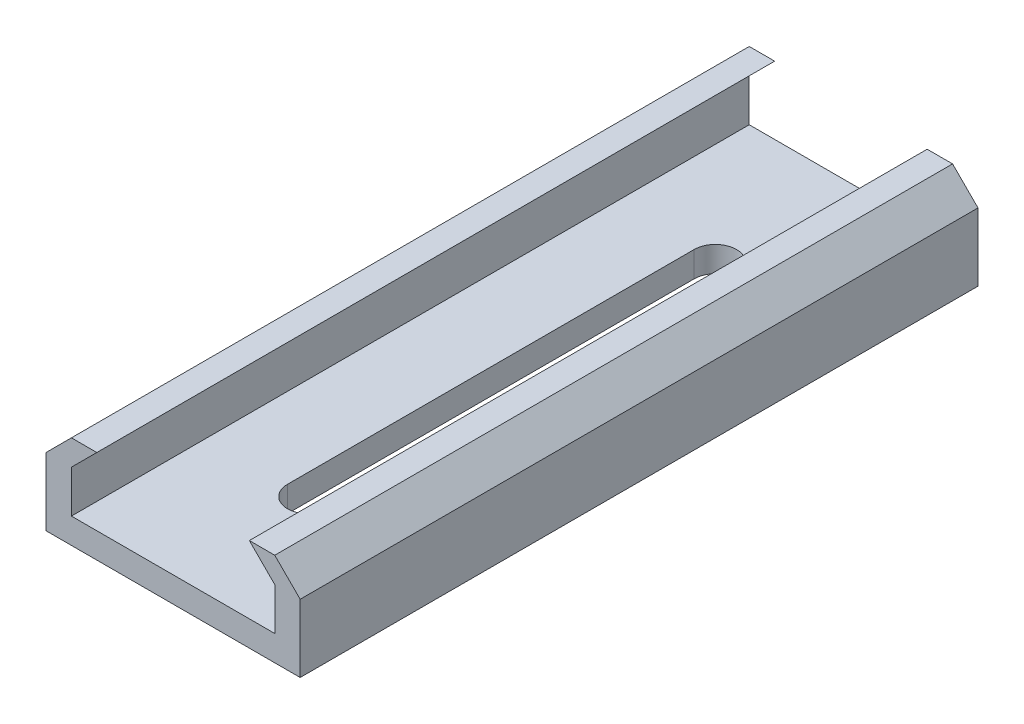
ISO-10303-21;
HEADER;
FILE_DESCRIPTION(('STEP AP214'),'2;1');
FILE_NAME('part.step','',(''),(''),'','','');
FILE_SCHEMA(('AUTOMOTIVE_DESIGN { 1 0 10303 214 1 1 1 1 }'));
ENDSEC;
DATA;
#1=APPLICATION_CONTEXT('core data for automotive mechanical design processes');
#2=APPLICATION_PROTOCOL_DEFINITION('international standard','automotive_design',2000,#1);
#3=PRODUCT_CONTEXT('',#1,'mechanical');
#4=PRODUCT('Part','Part','',(#3));
#5=PRODUCT_RELATED_PRODUCT_CATEGORY('part','',(#4));
#6=PRODUCT_DEFINITION_FORMATION('','',#4);
#7=PRODUCT_DEFINITION_CONTEXT('part definition',#1,'design');
#8=PRODUCT_DEFINITION('design','',#6,#7);
#9=PRODUCT_DEFINITION_SHAPE('','',#8);
#10=(LENGTH_UNIT() NAMED_UNIT(*) SI_UNIT(.MILLI.,.METRE.));
#11=(NAMED_UNIT(*) PLANE_ANGLE_UNIT() SI_UNIT($,.RADIAN.));
#12=(NAMED_UNIT(*) SI_UNIT($,.STERADIAN.) SOLID_ANGLE_UNIT());
#13=UNCERTAINTY_MEASURE_WITH_UNIT(LENGTH_MEASURE(1.E-05),#10,'distance_accuracy_value','');
#14=(GEOMETRIC_REPRESENTATION_CONTEXT(3) GLOBAL_UNCERTAINTY_ASSIGNED_CONTEXT((#13)) GLOBAL_UNIT_ASSIGNED_CONTEXT((#10,
#11,#12)) REPRESENTATION_CONTEXT('',''));
#15=CARTESIAN_POINT('',(0.,0.,0.));
#16=DIRECTION('',(0.,0.,1.));
#17=DIRECTION('',(1.,0.,0.));
#18=AXIS2_PLACEMENT_3D('',#15,#16,#17);
#19=CARTESIAN_POINT('',(-47.625,-9.525,-254.));
#20=DIRECTION('',(0.,-1.,0.));
#21=DIRECTION('',(1.,0.,0.));
#22=AXIS2_PLACEMENT_3D('',#19,#20,#21);
#23=PLANE('',#22);
#24=CARTESIAN_POINT('',(-25.4,-9.525,-203.2));
#25=DIRECTION('',(0.,-1.,0.));
#26=DIRECTION('',(0.,0.,-1.));
#27=AXIS2_PLACEMENT_3D('',#24,#25,#26);
#28=CIRCLE('',#27,7.87400000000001);
#29=CARTESIAN_POINT('',(-25.4,-9.525,-195.326));
#30=VERTEX_POINT('',#29);
#31=EDGE_CURVE('E451',#30,#30,#28,.T.);
#32=ORIENTED_EDGE('',*,*,#31,.F.);
#33=EDGE_LOOP('',(#32));
#34=FACE_BOUND('',#33,.T.);
#35=CARTESIAN_POINT('',(-1.75207071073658E-13,-9.52499999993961,-203.2));
#36=DIRECTION('',(0.,-1.,0.));
#37=DIRECTION('',(0.,0.,-1.));
#38=AXIS2_PLACEMENT_3D('',#35,#36,#37);
#39=CIRCLE('',#38,7.93750000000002);
#40=CARTESIAN_POINT('',(-7.93750000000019,-9.52499999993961,-203.2));
#41=VERTEX_POINT('',#40);
#42=CARTESIAN_POINT('',(7.93749999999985,-9.525,-203.2));
#43=VERTEX_POINT('',#42);
#44=EDGE_CURVE('E53',#41,#43,#39,.T.);
#45=ORIENTED_EDGE('',*,*,#44,.F.);
#46=DIRECTION('',(0.,0.,1.));
#47=VECTOR('',#46,1.);
#48=CARTESIAN_POINT('',(-7.93750000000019,-9.52499999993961,-203.2));
#49=LINE('',#48,#47);
#50=CARTESIAN_POINT('',(-7.93750000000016,-9.52499999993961,-50.7999999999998));
#51=VERTEX_POINT('',#50);
#52=EDGE_CURVE('E160',#41,#51,#49,.T.);
#53=ORIENTED_EDGE('',*,*,#52,.T.);
#54=CARTESIAN_POINT('',(-1.87350135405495E-13,-9.52499999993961,-50.7999999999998));
#55=DIRECTION('',(0.,1.,0.));
#56=DIRECTION('',(0.,0.,1.));
#57=AXIS2_PLACEMENT_3D('',#54,#55,#56);
#58=CIRCLE('',#57,7.93749999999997);
#59=CARTESIAN_POINT('',(7.93749999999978,-9.52499999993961,-50.7999999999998));
#60=VERTEX_POINT('',#59);
#61=EDGE_CURVE('E145',#51,#60,#58,.T.);
#62=ORIENTED_EDGE('',*,*,#61,.T.);
#63=DIRECTION('',(0.,0.,-1.));
#64=VECTOR('',#63,1.);
#65=CARTESIAN_POINT('',(7.93749999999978,-9.52499999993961,-50.7999999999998));
#66=LINE('',#65,#64);
#67=EDGE_CURVE('E154',#60,#43,#66,.T.);
#68=ORIENTED_EDGE('',*,*,#67,.T.);
#69=EDGE_LOOP('',(#45,#53,#62,#68));
#70=FACE_BOUND('',#69,.T.);
#71=DIRECTION('',(1.,0.,0.));
#72=VECTOR('',#71,1.);
#73=CARTESIAN_POINT('',(-47.625,-9.525,0.));
#74=LINE('',#73,#72);
#75=CARTESIAN_POINT('',(-47.625,-9.525,0.));
#76=VERTEX_POINT('',#75);
#77=CARTESIAN_POINT('',(47.625,-9.525,0.));
#78=VERTEX_POINT('',#77);
#79=EDGE_CURVE('E180',#76,#78,#74,.T.);
#80=ORIENTED_EDGE('',*,*,#79,.F.);
#81=DIRECTION('',(0.,0.,1.));
#82=VECTOR('',#81,1.);
#83=CARTESIAN_POINT('',(-47.625,-9.525,-254.));
#84=LINE('',#83,#82);
#85=CARTESIAN_POINT('',(-47.625,-9.525,-254.));
#86=VERTEX_POINT('',#85);
#87=EDGE_CURVE('E32',#86,#76,#84,.T.);
#88=ORIENTED_EDGE('',*,*,#87,.F.);
#89=DIRECTION('',(1.,0.,0.));
#90=VECTOR('',#89,1.);
#91=CARTESIAN_POINT('',(-47.625,-9.525,-254.));
#92=LINE('',#91,#90);
#93=CARTESIAN_POINT('',(47.625,-9.525,-254.));
#94=VERTEX_POINT('',#93);
#95=EDGE_CURVE('E216',#86,#94,#92,.T.);
#96=ORIENTED_EDGE('',*,*,#95,.T.);
#97=DIRECTION('',(0.,0.,1.));
#98=VECTOR('',#97,1.);
#99=CARTESIAN_POINT('',(47.625,-9.525,-254.));
#100=LINE('',#99,#98);
#101=EDGE_CURVE('E265',#94,#78,#100,.T.);
#102=ORIENTED_EDGE('',*,*,#101,.T.);
#103=EDGE_LOOP('',(#80,#88,#96,#102));
#104=FACE_BOUND('',#103,.T.);
#105=CARTESIAN_POINT('',(25.4,-9.525,-203.2));
#106=DIRECTION('',(0.,-1.,0.));
#107=DIRECTION('',(0.,0.,1.));
#108=AXIS2_PLACEMENT_3D('',#105,#106,#107);
#109=CIRCLE('',#108,7.87400000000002);
#110=CARTESIAN_POINT('',(25.4,-9.525,-195.326));
#111=VERTEX_POINT('',#110);
#112=EDGE_CURVE('E452',#111,#111,#109,.T.);
#113=ORIENTED_EDGE('',*,*,#112,.F.);
#114=EDGE_LOOP('',(#113));
#115=FACE_BOUND('',#114,.T.);
#116=ADVANCED_FACE('F28',(#34,#70,#104,#115),#23,.T.);
#117=CARTESIAN_POINT('',(-47.625,-9.525,-254.));
#118=DIRECTION('',(-1.,0.,0.));
#119=DIRECTION('',(0.,-1.,0.));
#120=AXIS2_PLACEMENT_3D('',#117,#118,#119);
#121=PLANE('',#120);
#122=DIRECTION('',(0.,-1.,0.));
#123=VECTOR('',#122,1.);
#124=CARTESIAN_POINT('',(-47.625,-9.525,0.));
#125=LINE('',#124,#123);
#126=CARTESIAN_POINT('',(-47.625,15.875,0.));
#127=VERTEX_POINT('',#126);
#128=EDGE_CURVE('E177',#127,#76,#125,.T.);
#129=ORIENTED_EDGE('',*,*,#128,.F.);
#130=DIRECTION('',(0.,0.,1.));
#131=VECTOR('',#130,1.);
#132=CARTESIAN_POINT('',(-47.625,15.875,-254.));
#133=LINE('',#132,#131);
#134=CARTESIAN_POINT('',(-47.625,15.875,-254.));
#135=VERTEX_POINT('',#134);
#136=EDGE_CURVE('E11',#135,#127,#133,.T.);
#137=ORIENTED_EDGE('',*,*,#136,.F.);
#138=DIRECTION('',(0.,-1.,0.));
#139=VECTOR('',#138,1.);
#140=CARTESIAN_POINT('',(-47.625,-9.525,-254.));
#141=LINE('',#140,#139);
#142=EDGE_CURVE('E213',#135,#86,#141,.T.);
#143=ORIENTED_EDGE('',*,*,#142,.T.);
#144=ORIENTED_EDGE('',*,*,#87,.T.);
#145=EDGE_LOOP('',(#129,#137,#143,#144));
#146=FACE_BOUND('',#145,.T.);
#147=ADVANCED_FACE('F30',(#146),#121,.T.);
#148=CARTESIAN_POINT('',(-47.625,15.875,-254.));
#149=DIRECTION('',(-0.707106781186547,0.707106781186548,0.));
#150=DIRECTION('',(-0.707106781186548,-0.707106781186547,0.));
#151=AXIS2_PLACEMENT_3D('',#148,#149,#150);
#152=PLANE('',#151);
#153=DIRECTION('',(-0.707106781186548,-0.707106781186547,0.));
#154=VECTOR('',#153,1.);
#155=CARTESIAN_POINT('',(-47.625,15.875,0.));
#156=LINE('',#155,#154);
#157=CARTESIAN_POINT('',(-38.1,25.4,0.));
#158=VERTEX_POINT('',#157);
#159=EDGE_CURVE('E210',#158,#127,#156,.T.);
#160=ORIENTED_EDGE('',*,*,#159,.F.);
#161=DIRECTION('',(0.,0.,1.));
#162=VECTOR('',#161,1.);
#163=CARTESIAN_POINT('',(-38.1,25.4,-254.));
#164=LINE('',#163,#162);
#165=CARTESIAN_POINT('',(-38.1,25.4,-254.));
#166=VERTEX_POINT('',#165);
#167=EDGE_CURVE('E37',#166,#158,#164,.T.);
#168=ORIENTED_EDGE('',*,*,#167,.F.);
#169=DIRECTION('',(-0.707106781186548,-0.707106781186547,0.));
#170=VECTOR('',#169,1.);
#171=CARTESIAN_POINT('',(-47.625,15.875,-254.));
#172=LINE('',#171,#170);
#173=EDGE_CURVE('E246',#166,#135,#172,.T.);
#174=ORIENTED_EDGE('',*,*,#173,.T.);
#175=ORIENTED_EDGE('',*,*,#136,.T.);
#176=EDGE_LOOP('',(#160,#168,#174,#175));
#177=FACE_BOUND('',#176,.T.);
#178=ADVANCED_FACE('F278',(#177),#152,.T.);
#179=CARTESIAN_POINT('',(-38.1,25.4,-254.));
#180=DIRECTION('',(0.,1.,0.));
#181=DIRECTION('',(0.,0.,1.));
#182=AXIS2_PLACEMENT_3D('',#179,#180,#181);
#183=PLANE('',#182);
#184=DIRECTION('',(-1.,0.,0.));
#185=VECTOR('',#184,1.);
#186=CARTESIAN_POINT('',(-38.1,25.4,0.));
#187=LINE('',#186,#185);
#188=CARTESIAN_POINT('',(-28.575,25.4,0.));
#189=VERTEX_POINT('',#188);
#190=EDGE_CURVE('E207',#189,#158,#187,.T.);
#191=ORIENTED_EDGE('',*,*,#190,.F.);
#192=DIRECTION('',(0.,0.,1.));
#193=VECTOR('',#192,1.);
#194=CARTESIAN_POINT('',(-28.575,25.4,-254.));
#195=LINE('',#194,#193);
#196=CARTESIAN_POINT('',(-28.575,25.4,-254.));
#197=VERTEX_POINT('',#196);
#198=EDGE_CURVE('E250',#197,#189,#195,.T.);
#199=ORIENTED_EDGE('',*,*,#198,.F.);
#200=DIRECTION('',(-1.,0.,0.));
#201=VECTOR('',#200,1.);
#202=CARTESIAN_POINT('',(-38.1,25.4,-254.));
#203=LINE('',#202,#201);
#204=EDGE_CURVE('E243',#197,#166,#203,.T.);
#205=ORIENTED_EDGE('',*,*,#204,.T.);
#206=ORIENTED_EDGE('',*,*,#167,.T.);
#207=EDGE_LOOP('',(#191,#199,#205,#206));
#208=FACE_BOUND('',#207,.T.);
#209=ADVANCED_FACE('F315',(#208),#183,.T.);
#210=CARTESIAN_POINT('',(-28.575,25.4,-254.));
#211=DIRECTION('',(0.707106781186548,-0.707106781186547,0.));
#212=DIRECTION('',(0.707106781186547,0.707106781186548,0.));
#213=AXIS2_PLACEMENT_3D('',#210,#211,#212);
#214=PLANE('',#213);
#215=DIRECTION('',(0.707106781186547,0.707106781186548,0.));
#216=VECTOR('',#215,1.);
#217=CARTESIAN_POINT('',(-28.575,25.4,0.));
#218=LINE('',#217,#216);
#219=CARTESIAN_POINT('',(-38.1,15.875,0.));
#220=VERTEX_POINT('',#219);
#221=EDGE_CURVE('E204',#220,#189,#218,.T.);
#222=ORIENTED_EDGE('',*,*,#221,.F.);
#223=DIRECTION('',(0.,0.,1.));
#224=VECTOR('',#223,1.);
#225=CARTESIAN_POINT('',(-38.1,15.875,-254.));
#226=LINE('',#225,#224);
#227=CARTESIAN_POINT('',(-38.1,15.875,-254.));
#228=VERTEX_POINT('',#227);
#229=EDGE_CURVE('E252',#228,#220,#226,.T.);
#230=ORIENTED_EDGE('',*,*,#229,.F.);
#231=DIRECTION('',(0.707106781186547,0.707106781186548,0.));
#232=VECTOR('',#231,1.);
#233=CARTESIAN_POINT('',(-28.575,25.4,-254.));
#234=LINE('',#233,#232);
#235=EDGE_CURVE('E240',#228,#197,#234,.T.);
#236=ORIENTED_EDGE('',*,*,#235,.T.);
#237=ORIENTED_EDGE('',*,*,#198,.T.);
#238=EDGE_LOOP('',(#222,#230,#236,#237));
#239=FACE_BOUND('',#238,.T.);
#240=ADVANCED_FACE('F312',(#239),#214,.T.);
#241=CARTESIAN_POINT('',(-38.1,15.875,-254.));
#242=DIRECTION('',(1.,0.,0.));
#243=DIRECTION('',(0.,1.,0.));
#244=AXIS2_PLACEMENT_3D('',#241,#242,#243);
#245=PLANE('',#244);
#246=DIRECTION('',(0.,1.,0.));
#247=VECTOR('',#246,1.);
#248=CARTESIAN_POINT('',(-38.1,15.875,0.));
#249=LINE('',#248,#247);
#250=CARTESIAN_POINT('',(-38.1,0.,0.));
#251=VERTEX_POINT('',#250);
#252=EDGE_CURVE('E201',#251,#220,#249,.T.);
#253=ORIENTED_EDGE('',*,*,#252,.F.);
#254=DIRECTION('',(0.,0.,1.));
#255=VECTOR('',#254,1.);
#256=CARTESIAN_POINT('',(-38.1,0.,-254.));
#257=LINE('',#256,#255);
#258=CARTESIAN_POINT('',(-38.1,0.,-254.));
#259=VERTEX_POINT('',#258);
#260=EDGE_CURVE('E254',#259,#251,#257,.T.);
#261=ORIENTED_EDGE('',*,*,#260,.F.);
#262=DIRECTION('',(0.,1.,0.));
#263=VECTOR('',#262,1.);
#264=CARTESIAN_POINT('',(-38.1,15.875,-254.));
#265=LINE('',#264,#263);
#266=EDGE_CURVE('E237',#259,#228,#265,.T.);
#267=ORIENTED_EDGE('',*,*,#266,.T.);
#268=ORIENTED_EDGE('',*,*,#229,.T.);
#269=EDGE_LOOP('',(#253,#261,#267,#268));
#270=FACE_BOUND('',#269,.T.);
#271=ADVANCED_FACE('F309',(#270),#245,.T.);
#272=CARTESIAN_POINT('',(-38.1,0.,-254.));
#273=DIRECTION('',(0.,1.,0.));
#274=DIRECTION('',(0.,0.,1.));
#275=AXIS2_PLACEMENT_3D('',#272,#273,#274);
#276=PLANE('',#275);
#277=CARTESIAN_POINT('',(-1.75207071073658E-13,0.,-203.2));
#278=DIRECTION('',(0.,1.,0.));
#279=DIRECTION('',(0.,0.,1.));
#280=AXIS2_PLACEMENT_3D('',#277,#278,#279);
#281=CIRCLE('',#280,7.93750000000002);
#282=CARTESIAN_POINT('',(7.93749999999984,0.,-203.2));
#283=VERTEX_POINT('',#282);
#284=CARTESIAN_POINT('',(-7.93750000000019,0.,-203.2));
#285=VERTEX_POINT('',#284);
#286=EDGE_CURVE('E175',#283,#285,#281,.T.);
#287=ORIENTED_EDGE('',*,*,#286,.F.);
#288=DIRECTION('',(0.,0.,1.));
#289=VECTOR('',#288,1.);
#290=CARTESIAN_POINT('',(7.93749999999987,0.,-254.));
#291=LINE('',#290,#289);
#292=CARTESIAN_POINT('',(7.93749999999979,0.,-50.7999999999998));
#293=VERTEX_POINT('',#292);
#294=EDGE_CURVE('E167',#283,#293,#291,.T.);
#295=ORIENTED_EDGE('',*,*,#294,.T.);
#296=CARTESIAN_POINT('',(-1.87350135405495E-13,0.,-50.7999999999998));
#297=DIRECTION('',(0.,1.,0.));
#298=DIRECTION('',(0.,0.,1.));
#299=AXIS2_PLACEMENT_3D('',#296,#297,#298);
#300=CIRCLE('',#299,7.93749999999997);
#301=CARTESIAN_POINT('',(-7.93750000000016,0.,-50.7999999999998));
#302=VERTEX_POINT('',#301);
#303=EDGE_CURVE('E148',#293,#302,#300,.F.);
#304=ORIENTED_EDGE('',*,*,#303,.T.);
#305=DIRECTION('',(0.,0.,-1.));
#306=VECTOR('',#305,1.);
#307=CARTESIAN_POINT('',(-7.93750000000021,0.,-254.));
#308=LINE('',#307,#306);
#309=EDGE_CURVE('E172',#302,#285,#308,.T.);
#310=ORIENTED_EDGE('',*,*,#309,.T.);
#311=EDGE_LOOP('',(#287,#295,#304,#310));
#312=FACE_BOUND('',#311,.T.);
#313=DIRECTION('',(-1.,0.,0.));
#314=VECTOR('',#313,1.);
#315=CARTESIAN_POINT('',(-38.1,0.,0.));
#316=LINE('',#315,#314);
#317=CARTESIAN_POINT('',(38.1,0.,0.));
#318=VERTEX_POINT('',#317);
#319=EDGE_CURVE('E198',#318,#251,#316,.T.);
#320=ORIENTED_EDGE('',*,*,#319,.F.);
#321=DIRECTION('',(0.,0.,1.));
#322=VECTOR('',#321,1.);
#323=CARTESIAN_POINT('',(38.1,0.,-254.));
#324=LINE('',#323,#322);
#325=CARTESIAN_POINT('',(38.1,0.,-254.));
#326=VERTEX_POINT('',#325);
#327=EDGE_CURVE('E256',#326,#318,#324,.T.);
#328=ORIENTED_EDGE('',*,*,#327,.F.);
#329=DIRECTION('',(-1.,0.,0.));
#330=VECTOR('',#329,1.);
#331=CARTESIAN_POINT('',(-38.1,0.,-254.));
#332=LINE('',#331,#330);
#333=EDGE_CURVE('E234',#326,#259,#332,.T.);
#334=ORIENTED_EDGE('',*,*,#333,.T.);
#335=ORIENTED_EDGE('',*,*,#260,.T.);
#336=EDGE_LOOP('',(#320,#328,#334,#335));
#337=FACE_BOUND('',#336,.T.);
#338=ADVANCED_FACE('F305',(#312,#337),#276,.T.);
#339=CARTESIAN_POINT('',(38.1,0.,-254.));
#340=DIRECTION('',(-1.,0.,0.));
#341=DIRECTION('',(0.,-1.,0.));
#342=AXIS2_PLACEMENT_3D('',#339,#340,#341);
#343=PLANE('',#342);
#344=DIRECTION('',(0.,-1.,0.));
#345=VECTOR('',#344,1.);
#346=CARTESIAN_POINT('',(38.1,0.,0.));
#347=LINE('',#346,#345);
#348=CARTESIAN_POINT('',(38.1,15.875,0.));
#349=VERTEX_POINT('',#348);
#350=EDGE_CURVE('E195',#349,#318,#347,.T.);
#351=ORIENTED_EDGE('',*,*,#350,.F.);
#352=DIRECTION('',(0.,0.,1.));
#353=VECTOR('',#352,1.);
#354=CARTESIAN_POINT('',(38.1,15.875,-254.));
#355=LINE('',#354,#353);
#356=CARTESIAN_POINT('',(38.1,15.875,-254.));
#357=VERTEX_POINT('',#356);
#358=EDGE_CURVE('E258',#357,#349,#355,.T.);
#359=ORIENTED_EDGE('',*,*,#358,.F.);
#360=DIRECTION('',(0.,-1.,0.));
#361=VECTOR('',#360,1.);
#362=CARTESIAN_POINT('',(38.1,0.,-254.));
#363=LINE('',#362,#361);
#364=EDGE_CURVE('E231',#357,#326,#363,.T.);
#365=ORIENTED_EDGE('',*,*,#364,.T.);
#366=ORIENTED_EDGE('',*,*,#327,.T.);
#367=EDGE_LOOP('',(#351,#359,#365,#366));
#368=FACE_BOUND('',#367,.T.);
#369=ADVANCED_FACE('F301',(#368),#343,.T.);
#370=CARTESIAN_POINT('',(38.1,15.875,-254.));
#371=DIRECTION('',(-0.707106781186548,-0.707106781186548,0.));
#372=DIRECTION('',(0.707106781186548,-0.707106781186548,0.));
#373=AXIS2_PLACEMENT_3D('',#370,#371,#372);
#374=PLANE('',#373);
#375=DIRECTION('',(0.707106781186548,-0.707106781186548,0.));
#376=VECTOR('',#375,1.);
#377=CARTESIAN_POINT('',(38.1,15.875,0.));
#378=LINE('',#377,#376);
#379=CARTESIAN_POINT('',(28.575,25.4,0.));
#380=VERTEX_POINT('',#379);
#381=EDGE_CURVE('E192',#380,#349,#378,.T.);
#382=ORIENTED_EDGE('',*,*,#381,.F.);
#383=DIRECTION('',(0.,0.,1.));
#384=VECTOR('',#383,1.);
#385=CARTESIAN_POINT('',(28.575,25.4,-254.));
#386=LINE('',#385,#384);
#387=CARTESIAN_POINT('',(28.575,25.4,-254.));
#388=VERTEX_POINT('',#387);
#389=EDGE_CURVE('E260',#388,#380,#386,.T.);
#390=ORIENTED_EDGE('',*,*,#389,.F.);
#391=DIRECTION('',(0.707106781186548,-0.707106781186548,0.));
#392=VECTOR('',#391,1.);
#393=CARTESIAN_POINT('',(38.1,15.875,-254.));
#394=LINE('',#393,#392);
#395=EDGE_CURVE('E228',#388,#357,#394,.T.);
#396=ORIENTED_EDGE('',*,*,#395,.T.);
#397=ORIENTED_EDGE('',*,*,#358,.T.);
#398=EDGE_LOOP('',(#382,#390,#396,#397));
#399=FACE_BOUND('',#398,.T.);
#400=ADVANCED_FACE('F297',(#399),#374,.T.);
#401=CARTESIAN_POINT('',(28.575,25.4,-254.));
#402=DIRECTION('',(0.,1.,0.));
#403=DIRECTION('',(0.,0.,1.));
#404=AXIS2_PLACEMENT_3D('',#401,#402,#403);
#405=PLANE('',#404);
#406=DIRECTION('',(-1.,0.,0.));
#407=VECTOR('',#406,1.);
#408=CARTESIAN_POINT('',(28.575,25.4,0.));
#409=LINE('',#408,#407);
#410=CARTESIAN_POINT('',(38.1,25.4,0.));
#411=VERTEX_POINT('',#410);
#412=EDGE_CURVE('E189',#411,#380,#409,.T.);
#413=ORIENTED_EDGE('',*,*,#412,.F.);
#414=DIRECTION('',(0.,0.,1.));
#415=VECTOR('',#414,1.);
#416=CARTESIAN_POINT('',(38.1,25.4,-254.));
#417=LINE('',#416,#415);
#418=CARTESIAN_POINT('',(38.1,25.4,-254.));
#419=VERTEX_POINT('',#418);
#420=EDGE_CURVE('E262',#419,#411,#417,.T.);
#421=ORIENTED_EDGE('',*,*,#420,.F.);
#422=DIRECTION('',(-1.,0.,0.));
#423=VECTOR('',#422,1.);
#424=CARTESIAN_POINT('',(28.575,25.4,-254.));
#425=LINE('',#424,#423);
#426=EDGE_CURVE('E225',#419,#388,#425,.T.);
#427=ORIENTED_EDGE('',*,*,#426,.T.);
#428=ORIENTED_EDGE('',*,*,#389,.T.);
#429=EDGE_LOOP('',(#413,#421,#427,#428));
#430=FACE_BOUND('',#429,.T.);
#431=ADVANCED_FACE('F293',(#430),#405,.T.);
#432=CARTESIAN_POINT('',(38.1,25.4,-254.));
#433=DIRECTION('',(0.707106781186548,0.707106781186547,0.));
#434=DIRECTION('',(-0.707106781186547,0.707106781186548,0.));
#435=AXIS2_PLACEMENT_3D('',#432,#433,#434);
#436=PLANE('',#435);
#437=DIRECTION('',(-0.707106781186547,0.707106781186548,0.));
#438=VECTOR('',#437,1.);
#439=CARTESIAN_POINT('',(38.1,25.4,0.));
#440=LINE('',#439,#438);
#441=CARTESIAN_POINT('',(47.625,15.875,0.));
#442=VERTEX_POINT('',#441);
#443=EDGE_CURVE('E186',#442,#411,#440,.T.);
#444=ORIENTED_EDGE('',*,*,#443,.F.);
#445=DIRECTION('',(0.,0.,1.));
#446=VECTOR('',#445,1.);
#447=CARTESIAN_POINT('',(47.625,15.875,-254.));
#448=LINE('',#447,#446);
#449=CARTESIAN_POINT('',(47.625,15.875,-254.));
#450=VERTEX_POINT('',#449);
#451=EDGE_CURVE('E264',#450,#442,#448,.T.);
#452=ORIENTED_EDGE('',*,*,#451,.F.);
#453=DIRECTION('',(-0.707106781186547,0.707106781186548,0.));
#454=VECTOR('',#453,1.);
#455=CARTESIAN_POINT('',(38.1,25.4,-254.));
#456=LINE('',#455,#454);
#457=EDGE_CURVE('E222',#450,#419,#456,.T.);
#458=ORIENTED_EDGE('',*,*,#457,.T.);
#459=ORIENTED_EDGE('',*,*,#420,.T.);
#460=EDGE_LOOP('',(#444,#452,#458,#459));
#461=FACE_BOUND('',#460,.T.);
#462=ADVANCED_FACE('F291',(#461),#436,.T.);
#463=CARTESIAN_POINT('',(47.625,-9.525,-254.));
#464=DIRECTION('',(1.,0.,0.));
#465=DIRECTION('',(0.,0.,-1.));
#466=AXIS2_PLACEMENT_3D('',#463,#464,#465);
#467=PLANE('',#466);
#468=DIRECTION('',(0.,1.,0.));
#469=VECTOR('',#468,1.);
#470=CARTESIAN_POINT('',(47.625,-9.525,0.));
#471=LINE('',#470,#469);
#472=EDGE_CURVE('E183',#78,#442,#471,.T.);
#473=ORIENTED_EDGE('',*,*,#472,.F.);
#474=ORIENTED_EDGE('',*,*,#101,.F.);
#475=DIRECTION('',(0.,1.,0.));
#476=VECTOR('',#475,1.);
#477=CARTESIAN_POINT('',(47.625,-9.525,-254.));
#478=LINE('',#477,#476);
#479=EDGE_CURVE('E219',#94,#450,#478,.T.);
#480=ORIENTED_EDGE('',*,*,#479,.T.);
#481=ORIENTED_EDGE('',*,*,#451,.T.);
#482=EDGE_LOOP('',(#473,#474,#480,#481));
#483=FACE_BOUND('',#482,.T.);
#484=ADVANCED_FACE('F287',(#483),#467,.T.);
#485=CARTESIAN_POINT('',(-47.625,0.,-254.));
#486=DIRECTION('',(0.,0.,-1.));
#487=DIRECTION('',(-1.,0.,0.));
#488=AXIS2_PLACEMENT_3D('',#485,#486,#487);
#489=PLANE('',#488);
#490=ORIENTED_EDGE('',*,*,#142,.F.);
#491=ORIENTED_EDGE('',*,*,#173,.F.);
#492=ORIENTED_EDGE('',*,*,#204,.F.);
#493=ORIENTED_EDGE('',*,*,#235,.F.);
#494=ORIENTED_EDGE('',*,*,#266,.F.);
#495=ORIENTED_EDGE('',*,*,#333,.F.);
#496=ORIENTED_EDGE('',*,*,#364,.F.);
#497=ORIENTED_EDGE('',*,*,#395,.F.);
#498=ORIENTED_EDGE('',*,*,#426,.F.);
#499=ORIENTED_EDGE('',*,*,#457,.F.);
#500=ORIENTED_EDGE('',*,*,#479,.F.);
#501=ORIENTED_EDGE('',*,*,#95,.F.);
#502=EDGE_LOOP('',(#490,#491,#492,#493,#494,#495,#496,#497,#498,#499,#500,#501));
#503=FACE_BOUND('',#502,.T.);
#504=ADVANCED_FACE('F281',(#503),#489,.T.);
#505=CARTESIAN_POINT('',(-47.625,0.,0.));
#506=DIRECTION('',(0.,0.,-1.));
#507=DIRECTION('',(-1.,0.,0.));
#508=AXIS2_PLACEMENT_3D('',#505,#506,#507);
#509=PLANE('',#508);
#510=ORIENTED_EDGE('',*,*,#128,.T.);
#511=ORIENTED_EDGE('',*,*,#79,.T.);
#512=ORIENTED_EDGE('',*,*,#472,.T.);
#513=ORIENTED_EDGE('',*,*,#443,.T.);
#514=ORIENTED_EDGE('',*,*,#412,.T.);
#515=ORIENTED_EDGE('',*,*,#381,.T.);
#516=ORIENTED_EDGE('',*,*,#350,.T.);
#517=ORIENTED_EDGE('',*,*,#319,.T.);
#518=ORIENTED_EDGE('',*,*,#252,.T.);
#519=ORIENTED_EDGE('',*,*,#221,.T.);
#520=ORIENTED_EDGE('',*,*,#190,.T.);
#521=ORIENTED_EDGE('',*,*,#159,.T.);
#522=EDGE_LOOP('',(#510,#511,#512,#513,#514,#515,#516,#517,#518,#519,#520,#521));
#523=FACE_BOUND('',#522,.T.);
#524=ADVANCED_FACE('F274',(#523),#509,.F.);
#525=CARTESIAN_POINT('',(-1.75207071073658E-13,25.4,-203.2));
#526=DIRECTION('',(0.,-1.,0.));
#527=DIRECTION('',(0.,0.,-1.));
#528=AXIS2_PLACEMENT_3D('',#525,#526,#527);
#529=CYLINDRICAL_SURFACE('',#528,7.93750000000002);
#530=ORIENTED_EDGE('',*,*,#286,.T.);
#531=DIRECTION('',(0.,-1.,0.));
#532=VECTOR('',#531,1.);
#533=CARTESIAN_POINT('',(-7.93750000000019,25.4,-203.2));
#534=LINE('',#533,#532);
#535=EDGE_CURVE('E165',#285,#41,#534,.T.);
#536=ORIENTED_EDGE('',*,*,#535,.T.);
#537=ORIENTED_EDGE('',*,*,#44,.T.);
#538=DIRECTION('',(0.,-1.,0.));
#539=VECTOR('',#538,1.);
#540=CARTESIAN_POINT('',(7.93749999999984,25.4,-203.2));
#541=LINE('',#540,#539);
#542=EDGE_CURVE('E151',#283,#43,#541,.T.);
#543=ORIENTED_EDGE('',*,*,#542,.F.);
#544=EDGE_LOOP('',(#530,#536,#537,#543));
#545=FACE_BOUND('',#544,.T.);
#546=ADVANCED_FACE('F383',(#545),#529,.F.);
#547=CARTESIAN_POINT('',(-7.93750000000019,25.4,-203.2));
#548=DIRECTION('',(1.,0.,0.));
#549=DIRECTION('',(0.,0.,-1.));
#550=AXIS2_PLACEMENT_3D('',#547,#548,#549);
#551=PLANE('',#550);
#552=DIRECTION('',(0.,-1.,0.));
#553=VECTOR('',#552,1.);
#554=CARTESIAN_POINT('',(-7.93750000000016,25.4,-50.7999999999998));
#555=LINE('',#554,#553);
#556=EDGE_CURVE('E150',#302,#51,#555,.T.);
#557=ORIENTED_EDGE('',*,*,#556,.T.);
#558=ORIENTED_EDGE('',*,*,#52,.F.);
#559=ORIENTED_EDGE('',*,*,#535,.F.);
#560=ORIENTED_EDGE('',*,*,#309,.F.);
#561=EDGE_LOOP('',(#557,#558,#559,#560));
#562=FACE_BOUND('',#561,.T.);
#563=ADVANCED_FACE('F394',(#562),#551,.T.);
#564=CARTESIAN_POINT('',(-1.87350135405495E-13,25.4,-50.7999999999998));
#565=DIRECTION('',(0.,-1.,0.));
#566=DIRECTION('',(0.,0.,-1.));
#567=AXIS2_PLACEMENT_3D('',#564,#565,#566);
#568=CYLINDRICAL_SURFACE('',#567,7.93749999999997);
#569=DIRECTION('',(0.,-1.,0.));
#570=VECTOR('',#569,1.);
#571=CARTESIAN_POINT('',(7.93749999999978,25.4,-50.7999999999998));
#572=LINE('',#571,#570);
#573=EDGE_CURVE('E45',#293,#60,#572,.T.);
#574=ORIENTED_EDGE('',*,*,#573,.T.);
#575=ORIENTED_EDGE('',*,*,#61,.F.);
#576=ORIENTED_EDGE('',*,*,#556,.F.);
#577=ORIENTED_EDGE('',*,*,#303,.F.);
#578=EDGE_LOOP('',(#574,#575,#576,#577));
#579=FACE_BOUND('',#578,.T.);
#580=ADVANCED_FACE('F142',(#579),#568,.F.);
#581=CARTESIAN_POINT('',(7.93749999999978,25.4,-50.7999999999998));
#582=DIRECTION('',(-1.,0.,0.));
#583=DIRECTION('',(0.,0.,1.));
#584=AXIS2_PLACEMENT_3D('',#581,#582,#583);
#585=PLANE('',#584);
#586=ORIENTED_EDGE('',*,*,#542,.T.);
#587=ORIENTED_EDGE('',*,*,#67,.F.);
#588=ORIENTED_EDGE('',*,*,#573,.F.);
#589=ORIENTED_EDGE('',*,*,#294,.F.);
#590=EDGE_LOOP('',(#586,#587,#588,#589));
#591=FACE_BOUND('',#590,.T.);
#592=ADVANCED_FACE('F155',(#591),#585,.T.);
#593=CARTESIAN_POINT('',(-25.4,-19.05,-203.2));
#594=DIRECTION('',(0.,1.,0.));
#595=DIRECTION('',(0.,0.,1.));
#596=AXIS2_PLACEMENT_3D('',#593,#594,#595);
#597=CYLINDRICAL_SURFACE('',#596,7.87400000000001);
#598=CARTESIAN_POINT('',(-25.4,-19.05,-203.2));
#599=DIRECTION('',(0.,-1.,0.));
#600=DIRECTION('',(0.,0.,-1.));
#601=AXIS2_PLACEMENT_3D('',#598,#599,#600);
#602=CIRCLE('',#601,7.87400000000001);
#603=CARTESIAN_POINT('',(-25.4,-19.05,-195.326));
#604=VERTEX_POINT('',#603);
#605=EDGE_CURVE('E455',#604,#604,#602,.T.);
#606=CARTESIAN_POINT('',(-25.4,-19.05,-195.326));
#607=CARTESIAN_POINT('',(-25.4,-18.95078125,-195.326));
#608=CARTESIAN_POINT('',(-25.4,-18.8515625,-195.326));
#609=CARTESIAN_POINT('',(-25.4,-18.653125,-195.326));
#610=CARTESIAN_POINT('',(-25.4,-18.55390625,-195.326));
#611=CARTESIAN_POINT('',(-25.4,-18.35546875,-195.326));
#612=CARTESIAN_POINT('',(-25.4,-18.25625,-195.326));
#613=CARTESIAN_POINT('',(-25.4,-18.0578125,-195.326));
#614=CARTESIAN_POINT('',(-25.4,-17.95859375,-195.326));
#615=CARTESIAN_POINT('',(-25.4,-17.76015625,-195.326));
#616=CARTESIAN_POINT('',(-25.4,-17.6609375,-195.326));
#617=CARTESIAN_POINT('',(-25.4,-17.4625,-195.326));
#618=CARTESIAN_POINT('',(-25.4,-17.36328125,-195.326));
#619=CARTESIAN_POINT('',(-25.4,-17.16484375,-195.326));
#620=CARTESIAN_POINT('',(-25.4,-17.065625,-195.326));
#621=CARTESIAN_POINT('',(-25.4,-16.8671875,-195.326));
#622=CARTESIAN_POINT('',(-25.4,-16.76796875,-195.326));
#623=CARTESIAN_POINT('',(-25.4,-16.56953125,-195.326));
#624=CARTESIAN_POINT('',(-25.4,-16.4703125,-195.326));
#625=CARTESIAN_POINT('',(-25.4,-16.271875,-195.326));
#626=CARTESIAN_POINT('',(-25.4,-16.17265625,-195.326));
#627=CARTESIAN_POINT('',(-25.4,-15.97421875,-195.326));
#628=CARTESIAN_POINT('',(-25.4,-15.875,-195.326));
#629=CARTESIAN_POINT('',(-25.4,-15.6765625,-195.326));
#630=CARTESIAN_POINT('',(-25.4,-15.57734375,-195.326));
#631=CARTESIAN_POINT('',(-25.4,-15.37890625,-195.326));
#632=CARTESIAN_POINT('',(-25.4,-15.2796875,-195.326));
#633=CARTESIAN_POINT('',(-25.4,-15.08125,-195.326));
#634=CARTESIAN_POINT('',(-25.4,-14.98203125,-195.326));
#635=CARTESIAN_POINT('',(-25.4,-14.78359375,-195.326));
#636=CARTESIAN_POINT('',(-25.4,-14.684375,-195.326));
#637=CARTESIAN_POINT('',(-25.4,-14.4859375,-195.326));
#638=CARTESIAN_POINT('',(-25.4,-14.38671875,-195.326));
#639=CARTESIAN_POINT('',(-25.4,-14.18828125,-195.326));
#640=CARTESIAN_POINT('',(-25.4,-14.0890625,-195.326));
#641=CARTESIAN_POINT('',(-25.4,-13.890625,-195.326));
#642=CARTESIAN_POINT('',(-25.4,-13.79140625,-195.326));
#643=CARTESIAN_POINT('',(-25.4,-13.59296875,-195.326));
#644=CARTESIAN_POINT('',(-25.4,-13.49375,-195.326));
#645=CARTESIAN_POINT('',(-25.4,-13.2953125,-195.326));
#646=CARTESIAN_POINT('',(-25.4,-13.19609375,-195.326));
#647=CARTESIAN_POINT('',(-25.4,-12.99765625,-195.326));
#648=CARTESIAN_POINT('',(-25.4,-12.8984375,-195.326));
#649=CARTESIAN_POINT('',(-25.4,-12.7,-195.326));
#650=CARTESIAN_POINT('',(-25.4,-12.60078125,-195.326));
#651=CARTESIAN_POINT('',(-25.4,-12.40234375,-195.326));
#652=CARTESIAN_POINT('',(-25.4,-12.303125,-195.326));
#653=CARTESIAN_POINT('',(-25.4,-12.1046875,-195.326));
#654=CARTESIAN_POINT('',(-25.4,-12.00546875,-195.326));
#655=CARTESIAN_POINT('',(-25.4,-11.80703125,-195.326));
#656=CARTESIAN_POINT('',(-25.4,-11.7078125,-195.326));
#657=CARTESIAN_POINT('',(-25.4,-11.509375,-195.326));
#658=CARTESIAN_POINT('',(-25.4,-11.41015625,-195.326));
#659=CARTESIAN_POINT('',(-25.4,-11.21171875,-195.326));
#660=CARTESIAN_POINT('',(-25.4,-11.1125,-195.326));
#661=CARTESIAN_POINT('',(-25.4,-10.9140625,-195.326));
#662=CARTESIAN_POINT('',(-25.4,-10.81484375,-195.326));
#663=CARTESIAN_POINT('',(-25.4,-10.61640625,-195.326));
#664=CARTESIAN_POINT('',(-25.4,-10.5171875,-195.326));
#665=CARTESIAN_POINT('',(-25.4,-10.31875,-195.326));
#666=CARTESIAN_POINT('',(-25.4,-10.21953125,-195.326));
#667=CARTESIAN_POINT('',(-25.4,-10.02109375,-195.326));
#668=CARTESIAN_POINT('',(-25.4,-9.921875,-195.326));
#669=CARTESIAN_POINT('',(-25.4,-9.7234375,-195.326));
#670=CARTESIAN_POINT('',(-25.4,-9.62421875,-195.326));
#671=CARTESIAN_POINT('',(-25.4,-9.525,-195.326));
#672=B_SPLINE_CURVE_WITH_KNOTS('',3,(#606,#607,#608,#609,#610,#611,#612,#613,#614,#615,#616,
#617,#618,#619,#620,#621,#622,#623,#624,#625,#626,#627,#628,#629,#630,#631,#632,#633,#634,#635,
#636,#637,#638,#639,#640,#641,#642,#643,#644,#645,#646,#647,#648,#649,#650,#651,#652,#653,#654,
#655,#656,#657,#658,#659,#660,#661,#662,#663,#664,#665,#666,#667,#668,#669,#670,#671),
.UNSPECIFIED.,.F.,.F.,(4,2,2,2,2,2,2,2,2,2,2,2,2,2,2,2,2,2,2,2,2,2,2,2,2,2,2,2,2,2,2,2,4),(0.,
0.29765625,0.5953125,0.892968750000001,1.190625,1.48828125,1.7859375,2.08359375,2.38125,
2.67890625,2.9765625,3.27421875,3.571875,3.86953125,4.1671875,4.46484375,4.7625,5.06015625,
5.3578125,5.65546875,5.953125,6.25078125,6.5484375,6.84609375,7.14375,7.44140625,7.7390625,
8.03671875,8.334375,8.63203125,8.9296875,9.22734375,9.525),.UNSPECIFIED.);
#673=EDGE_CURVE('BSEAM412',#604,#30,#672,.T.);
#674=ORIENTED_EDGE('',*,*,#605,.F.);
#675=ORIENTED_EDGE('',*,*,#31,.T.);
#676=ORIENTED_EDGE('',*,*,#673,.T.);
#677=ORIENTED_EDGE('',*,*,#673,.F.);
#678=EDGE_LOOP('',(#674,#676,#675,#677));
#679=FACE_BOUND('',#678,.T.);
#680=ADVANCED_FACE('F412',(#679),#597,.T.);
#681=CARTESIAN_POINT('',(-25.4,-19.05,-203.2));
#682=DIRECTION('',(0.,-1.,0.));
#683=DIRECTION('',(0.,0.,-1.));
#684=AXIS2_PLACEMENT_3D('',#681,#682,#683);
#685=PLANE('',#684);
#686=ORIENTED_EDGE('',*,*,#605,.T.);
#687=EDGE_LOOP('',(#686));
#688=FACE_BOUND('',#687,.T.);
#689=ADVANCED_FACE('F422',(#688),#685,.T.);
#690=CARTESIAN_POINT('',(25.4,-19.05,-203.2));
#691=DIRECTION('',(0.,1.,0.));
#692=DIRECTION('',(0.,0.,1.));
#693=AXIS2_PLACEMENT_3D('',#690,#691,#692);
#694=CYLINDRICAL_SURFACE('',#693,7.87400000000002);
#695=CARTESIAN_POINT('',(25.4,-19.05,-203.2));
#696=DIRECTION('',(0.,-1.,0.));
#697=DIRECTION('',(0.,0.,1.));
#698=AXIS2_PLACEMENT_3D('',#695,#696,#697);
#699=CIRCLE('',#698,7.87400000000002);
#700=CARTESIAN_POINT('',(25.4,-19.05,-195.326));
#701=VERTEX_POINT('',#700);
#702=EDGE_CURVE('E450',#701,#701,#699,.T.);
#703=CARTESIAN_POINT('',(25.4,-19.05,-195.326));
#704=CARTESIAN_POINT('',(25.4,-18.95078125,-195.326));
#705=CARTESIAN_POINT('',(25.4,-18.8515625,-195.326));
#706=CARTESIAN_POINT('',(25.4,-18.653125,-195.326));
#707=CARTESIAN_POINT('',(25.4,-18.55390625,-195.326));
#708=CARTESIAN_POINT('',(25.4,-18.35546875,-195.326));
#709=CARTESIAN_POINT('',(25.4,-18.25625,-195.326));
#710=CARTESIAN_POINT('',(25.4,-18.0578125,-195.326));
#711=CARTESIAN_POINT('',(25.4,-17.95859375,-195.326));
#712=CARTESIAN_POINT('',(25.4,-17.76015625,-195.326));
#713=CARTESIAN_POINT('',(25.4,-17.6609375,-195.326));
#714=CARTESIAN_POINT('',(25.4,-17.4625,-195.326));
#715=CARTESIAN_POINT('',(25.4,-17.36328125,-195.326));
#716=CARTESIAN_POINT('',(25.4,-17.16484375,-195.326));
#717=CARTESIAN_POINT('',(25.4,-17.065625,-195.326));
#718=CARTESIAN_POINT('',(25.4,-16.8671875,-195.326));
#719=CARTESIAN_POINT('',(25.4,-16.76796875,-195.326));
#720=CARTESIAN_POINT('',(25.4,-16.56953125,-195.326));
#721=CARTESIAN_POINT('',(25.4,-16.4703125,-195.326));
#722=CARTESIAN_POINT('',(25.4,-16.271875,-195.326));
#723=CARTESIAN_POINT('',(25.4,-16.17265625,-195.326));
#724=CARTESIAN_POINT('',(25.4,-15.97421875,-195.326));
#725=CARTESIAN_POINT('',(25.4,-15.875,-195.326));
#726=CARTESIAN_POINT('',(25.4,-15.6765625,-195.326));
#727=CARTESIAN_POINT('',(25.4,-15.57734375,-195.326));
#728=CARTESIAN_POINT('',(25.4,-15.37890625,-195.326));
#729=CARTESIAN_POINT('',(25.4,-15.2796875,-195.326));
#730=CARTESIAN_POINT('',(25.4,-15.08125,-195.326));
#731=CARTESIAN_POINT('',(25.4,-14.98203125,-195.326));
#732=CARTESIAN_POINT('',(25.4,-14.78359375,-195.326));
#733=CARTESIAN_POINT('',(25.4,-14.684375,-195.326));
#734=CARTESIAN_POINT('',(25.4,-14.4859375,-195.326));
#735=CARTESIAN_POINT('',(25.4,-14.38671875,-195.326));
#736=CARTESIAN_POINT('',(25.4,-14.18828125,-195.326));
#737=CARTESIAN_POINT('',(25.4,-14.0890625,-195.326));
#738=CARTESIAN_POINT('',(25.4,-13.890625,-195.326));
#739=CARTESIAN_POINT('',(25.4,-13.79140625,-195.326));
#740=CARTESIAN_POINT('',(25.4,-13.59296875,-195.326));
#741=CARTESIAN_POINT('',(25.4,-13.49375,-195.326));
#742=CARTESIAN_POINT('',(25.4,-13.2953125,-195.326));
#743=CARTESIAN_POINT('',(25.4,-13.19609375,-195.326));
#744=CARTESIAN_POINT('',(25.4,-12.99765625,-195.326));
#745=CARTESIAN_POINT('',(25.4,-12.8984375,-195.326));
#746=CARTESIAN_POINT('',(25.4,-12.7,-195.326));
#747=CARTESIAN_POINT('',(25.4,-12.60078125,-195.326));
#748=CARTESIAN_POINT('',(25.4,-12.40234375,-195.326));
#749=CARTESIAN_POINT('',(25.4,-12.303125,-195.326));
#750=CARTESIAN_POINT('',(25.4,-12.1046875,-195.326));
#751=CARTESIAN_POINT('',(25.4,-12.00546875,-195.326));
#752=CARTESIAN_POINT('',(25.4,-11.80703125,-195.326));
#753=CARTESIAN_POINT('',(25.4,-11.7078125,-195.326));
#754=CARTESIAN_POINT('',(25.4,-11.509375,-195.326));
#755=CARTESIAN_POINT('',(25.4,-11.41015625,-195.326));
#756=CARTESIAN_POINT('',(25.4,-11.21171875,-195.326));
#757=CARTESIAN_POINT('',(25.4,-11.1125,-195.326));
#758=CARTESIAN_POINT('',(25.4,-10.9140625,-195.326));
#759=CARTESIAN_POINT('',(25.4,-10.81484375,-195.326));
#760=CARTESIAN_POINT('',(25.4,-10.61640625,-195.326));
#761=CARTESIAN_POINT('',(25.4,-10.5171875,-195.326));
#762=CARTESIAN_POINT('',(25.4,-10.31875,-195.326));
#763=CARTESIAN_POINT('',(25.4,-10.21953125,-195.326));
#764=CARTESIAN_POINT('',(25.4,-10.02109375,-195.326));
#765=CARTESIAN_POINT('',(25.4,-9.921875,-195.326));
#766=CARTESIAN_POINT('',(25.4,-9.7234375,-195.326));
#767=CARTESIAN_POINT('',(25.4,-9.62421875,-195.326));
#768=CARTESIAN_POINT('',(25.4,-9.525,-195.326));
#769=B_SPLINE_CURVE_WITH_KNOTS('',3,(#703,#704,#705,#706,#707,#708,#709,#710,#711,#712,#713,
#714,#715,#716,#717,#718,#719,#720,#721,#722,#723,#724,#725,#726,#727,#728,#729,#730,#731,#732,
#733,#734,#735,#736,#737,#738,#739,#740,#741,#742,#743,#744,#745,#746,#747,#748,#749,#750,#751,
#752,#753,#754,#755,#756,#757,#758,#759,#760,#761,#762,#763,#764,#765,#766,#767,#768),
.UNSPECIFIED.,.F.,.F.,(4,2,2,2,2,2,2,2,2,2,2,2,2,2,2,2,2,2,2,2,2,2,2,2,2,2,2,2,2,2,2,2,4),(0.,
0.29765625,0.5953125,0.892968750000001,1.190625,1.48828125,1.7859375,2.08359375,2.38125,
2.67890625,2.9765625,3.27421875,3.571875,3.86953125,4.1671875,4.46484375,4.7625,5.06015625,
5.3578125,5.65546875,5.953125,6.25078125,6.5484375,6.84609375,7.14375,7.44140625,7.7390625,
8.03671875,8.334375,8.63203125,8.9296875,9.22734375,9.525),.UNSPECIFIED.);
#770=EDGE_CURVE('BSEAM430',#701,#111,#769,.T.);
#771=ORIENTED_EDGE('',*,*,#702,.F.);
#772=ORIENTED_EDGE('',*,*,#112,.T.);
#773=ORIENTED_EDGE('',*,*,#770,.T.);
#774=ORIENTED_EDGE('',*,*,#770,.F.);
#775=EDGE_LOOP('',(#771,#773,#772,#774));
#776=FACE_BOUND('',#775,.T.);
#777=ADVANCED_FACE('F430',(#776),#694,.T.);
#778=CARTESIAN_POINT('',(25.4,-19.05,-203.2));
#779=DIRECTION('',(0.,1.,0.));
#780=DIRECTION('',(0.,0.,1.));
#781=AXIS2_PLACEMENT_3D('',#778,#779,#780);
#782=PLANE('',#781);
#783=ORIENTED_EDGE('',*,*,#702,.T.);
#784=EDGE_LOOP('',(#783));
#785=FACE_BOUND('',#784,.T.);
#786=ADVANCED_FACE('F438',(#785),#782,.F.);
#787=CLOSED_SHELL('',(#116,#147,#178,#209,#240,#271,#338,#369,#400,#431,#462,#484,#504,#524,
#546,#563,#580,#592,#680,#689,#777,#786));
#788=MANIFOLD_SOLID_BREP('B2',#787);
#789=ADVANCED_BREP_SHAPE_REPRESENTATION('',(#18,#788),#14);
#790=SHAPE_DEFINITION_REPRESENTATION(#9,#789);
ENDSEC;
END-ISO-10303-21;
